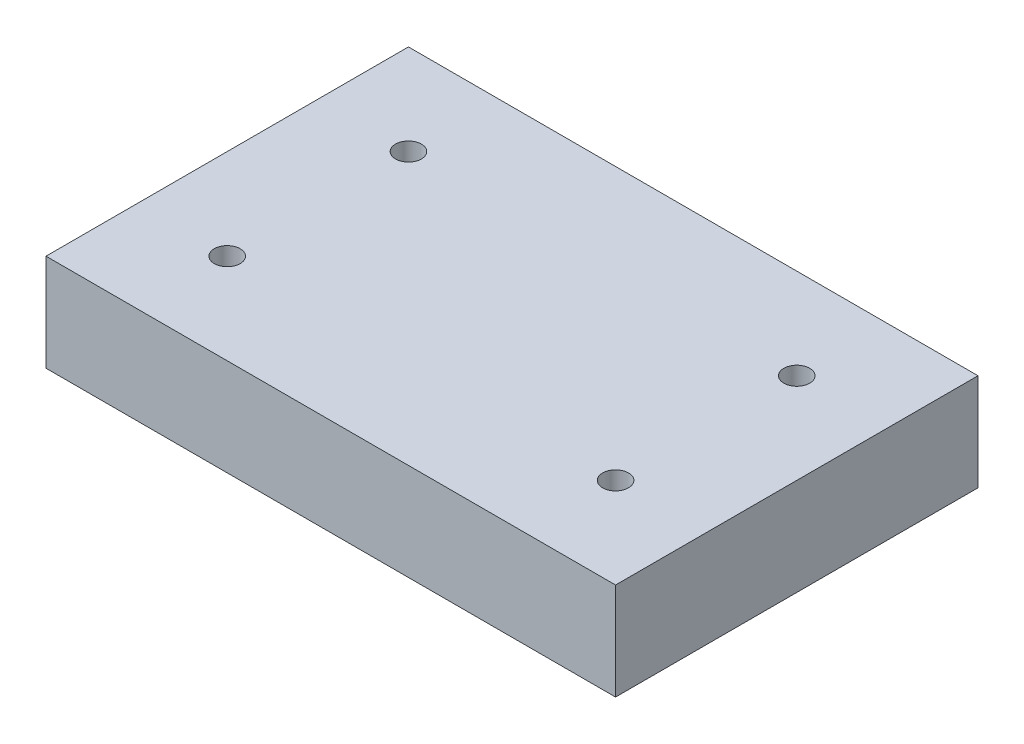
ISO-10303-21;
HEADER;
FILE_DESCRIPTION(('STEP AP214'),'2;1');
FILE_NAME('part.step','',(''),(''),'','','');
FILE_SCHEMA(('AUTOMOTIVE_DESIGN { 1 0 10303 214 1 1 1 1 }'));
ENDSEC;
DATA;
#1=APPLICATION_CONTEXT('core data for automotive mechanical design processes');
#2=APPLICATION_PROTOCOL_DEFINITION('international standard','automotive_design',2000,#1);
#3=PRODUCT_CONTEXT('',#1,'mechanical');
#4=PRODUCT('Part','Part','',(#3));
#5=PRODUCT_RELATED_PRODUCT_CATEGORY('part','',(#4));
#6=PRODUCT_DEFINITION_FORMATION('','',#4);
#7=PRODUCT_DEFINITION_CONTEXT('part definition',#1,'design');
#8=PRODUCT_DEFINITION('design','',#6,#7);
#9=PRODUCT_DEFINITION_SHAPE('','',#8);
#10=(LENGTH_UNIT() NAMED_UNIT(*) SI_UNIT(.MILLI.,.METRE.));
#11=(NAMED_UNIT(*) PLANE_ANGLE_UNIT() SI_UNIT($,.RADIAN.));
#12=(NAMED_UNIT(*) SI_UNIT($,.STERADIAN.) SOLID_ANGLE_UNIT());
#13=UNCERTAINTY_MEASURE_WITH_UNIT(LENGTH_MEASURE(1.E-05),#10,'distance_accuracy_value','');
#14=(GEOMETRIC_REPRESENTATION_CONTEXT(3) GLOBAL_UNCERTAINTY_ASSIGNED_CONTEXT((#13)) GLOBAL_UNIT_ASSIGNED_CONTEXT((#10,
#11,#12)) REPRESENTATION_CONTEXT('',''));
#15=CARTESIAN_POINT('',(0.,0.,0.));
#16=DIRECTION('',(0.,0.,1.));
#17=DIRECTION('',(1.,0.,0.));
#18=AXIS2_PLACEMENT_3D('',#15,#16,#17);
#19=CARTESIAN_POINT('',(0.,23.8125,-88.9));
#20=DIRECTION('',(1.,0.,0.));
#21=DIRECTION('',(0.,0.,-1.));
#22=AXIS2_PLACEMENT_3D('',#19,#20,#21);
#23=PLANE('',#22);
#24=DIRECTION('',(0.,0.,1.));
#25=VECTOR('',#24,1.);
#26=CARTESIAN_POINT('',(0.,0.,-88.9));
#27=LINE('',#26,#25);
#28=CARTESIAN_POINT('',(0.,0.,-88.9));
#29=VERTEX_POINT('',#28);
#30=CARTESIAN_POINT('',(0.,0.,0.));
#31=VERTEX_POINT('',#30);
#32=EDGE_CURVE('E96',#29,#31,#27,.T.);
#33=ORIENTED_EDGE('',*,*,#32,.T.);
#34=DIRECTION('',(0.,-1.,0.));
#35=VECTOR('',#34,1.);
#36=CARTESIAN_POINT('',(0.,23.8125,0.));
#37=LINE('',#36,#35);
#38=CARTESIAN_POINT('',(0.,23.8125,0.));
#39=VERTEX_POINT('',#38);
#40=EDGE_CURVE('E11',#39,#31,#37,.T.);
#41=ORIENTED_EDGE('',*,*,#40,.F.);
#42=DIRECTION('',(0.,0.,1.));
#43=VECTOR('',#42,1.);
#44=CARTESIAN_POINT('',(0.,23.8125,-88.9));
#45=LINE('',#44,#43);
#46=CARTESIAN_POINT('',(0.,23.8125,-88.9));
#47=VERTEX_POINT('',#46);
#48=EDGE_CURVE('E84',#47,#39,#45,.T.);
#49=ORIENTED_EDGE('',*,*,#48,.F.);
#50=DIRECTION('',(0.,-1.,0.));
#51=VECTOR('',#50,1.);
#52=CARTESIAN_POINT('',(0.,23.8125,-88.9));
#53=LINE('',#52,#51);
#54=EDGE_CURVE('E92',#47,#29,#53,.T.);
#55=ORIENTED_EDGE('',*,*,#54,.T.);
#56=EDGE_LOOP('',(#33,#41,#49,#55));
#57=FACE_BOUND('',#56,.T.);
#58=ADVANCED_FACE('F33',(#57),#23,.F.);
#59=CARTESIAN_POINT('',(0.,23.8125,0.));
#60=DIRECTION('',(0.,0.,-1.));
#61=DIRECTION('',(-1.,0.,0.));
#62=AXIS2_PLACEMENT_3D('',#59,#60,#61);
#63=PLANE('',#62);
#64=DIRECTION('',(1.,0.,0.));
#65=VECTOR('',#64,1.);
#66=CARTESIAN_POINT('',(0.,0.,0.));
#67=LINE('',#66,#65);
#68=CARTESIAN_POINT('',(139.7,0.,0.));
#69=VERTEX_POINT('',#68);
#70=EDGE_CURVE('E88',#31,#69,#67,.T.);
#71=ORIENTED_EDGE('',*,*,#70,.T.);
#72=DIRECTION('',(0.,-1.,0.));
#73=VECTOR('',#72,1.);
#74=CARTESIAN_POINT('',(139.7,23.8125,0.));
#75=LINE('',#74,#73);
#76=CARTESIAN_POINT('',(139.7,23.8125,0.));
#77=VERTEX_POINT('',#76);
#78=EDGE_CURVE('E41',#77,#69,#75,.T.);
#79=ORIENTED_EDGE('',*,*,#78,.F.);
#80=DIRECTION('',(1.,0.,0.));
#81=VECTOR('',#80,1.);
#82=CARTESIAN_POINT('',(0.,23.8125,0.));
#83=LINE('',#82,#81);
#84=EDGE_CURVE('E79',#39,#77,#83,.T.);
#85=ORIENTED_EDGE('',*,*,#84,.F.);
#86=ORIENTED_EDGE('',*,*,#40,.T.);
#87=EDGE_LOOP('',(#71,#79,#85,#86));
#88=FACE_BOUND('',#87,.T.);
#89=ADVANCED_FACE('F87',(#88),#63,.F.);
#90=CARTESIAN_POINT('',(139.7,23.8125,-88.9));
#91=DIRECTION('',(-1.,0.,0.));
#92=DIRECTION('',(0.,0.,1.));
#93=AXIS2_PLACEMENT_3D('',#90,#91,#92);
#94=PLANE('',#93);
#95=DIRECTION('',(0.,0.,-1.));
#96=VECTOR('',#95,1.);
#97=CARTESIAN_POINT('',(139.7,0.,-88.9));
#98=LINE('',#97,#96);
#99=CARTESIAN_POINT('',(139.7,0.,-88.9));
#100=VERTEX_POINT('',#99);
#101=EDGE_CURVE('E66',#69,#100,#98,.T.);
#102=ORIENTED_EDGE('',*,*,#101,.T.);
#103=DIRECTION('',(0.,-1.,0.));
#104=VECTOR('',#103,1.);
#105=CARTESIAN_POINT('',(139.7,23.8125,-88.9));
#106=LINE('',#105,#104);
#107=CARTESIAN_POINT('',(139.7,23.8125,-88.9));
#108=VERTEX_POINT('',#107);
#109=EDGE_CURVE('E89',#108,#100,#106,.T.);
#110=ORIENTED_EDGE('',*,*,#109,.F.);
#111=DIRECTION('',(0.,0.,-1.));
#112=VECTOR('',#111,1.);
#113=CARTESIAN_POINT('',(139.7,23.8125,-88.9));
#114=LINE('',#113,#112);
#115=EDGE_CURVE('E82',#77,#108,#114,.T.);
#116=ORIENTED_EDGE('',*,*,#115,.F.);
#117=ORIENTED_EDGE('',*,*,#78,.T.);
#118=EDGE_LOOP('',(#102,#110,#116,#117));
#119=FACE_BOUND('',#118,.T.);
#120=ADVANCED_FACE('F90',(#119),#94,.F.);
#121=CARTESIAN_POINT('',(0.,23.8125,-88.9));
#122=DIRECTION('',(0.,0.,1.));
#123=DIRECTION('',(1.,0.,0.));
#124=AXIS2_PLACEMENT_3D('',#121,#122,#123);
#125=PLANE('',#124);
#126=DIRECTION('',(-1.,0.,0.));
#127=VECTOR('',#126,1.);
#128=CARTESIAN_POINT('',(0.,0.,-88.9));
#129=LINE('',#128,#127);
#130=EDGE_CURVE('E72',#100,#29,#129,.T.);
#131=ORIENTED_EDGE('',*,*,#130,.T.);
#132=ORIENTED_EDGE('',*,*,#54,.F.);
#133=DIRECTION('',(-1.,0.,0.));
#134=VECTOR('',#133,1.);
#135=CARTESIAN_POINT('',(0.,23.8125,-88.9));
#136=LINE('',#135,#134);
#137=EDGE_CURVE('E49',#108,#47,#136,.T.);
#138=ORIENTED_EDGE('',*,*,#137,.F.);
#139=ORIENTED_EDGE('',*,*,#109,.T.);
#140=EDGE_LOOP('',(#131,#132,#138,#139));
#141=FACE_BOUND('',#140,.T.);
#142=ADVANCED_FACE('F104',(#141),#125,.F.);
#143=CARTESIAN_POINT('',(0.,23.8125,0.));
#144=DIRECTION('',(0.,1.,0.));
#145=DIRECTION('',(0.,0.,1.));
#146=AXIS2_PLACEMENT_3D('',#143,#144,#145);
#147=PLANE('',#146);
#148=CARTESIAN_POINT('',(22.225,23.8125,-66.675));
#149=DIRECTION('',(0.,1.,0.));
#150=DIRECTION('',(0.,0.,1.));
#151=AXIS2_PLACEMENT_3D('',#148,#149,#150);
#152=CIRCLE('',#151,3.17499999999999);
#153=CARTESIAN_POINT('',(22.225,23.8125,-63.5));
#154=VERTEX_POINT('',#153);
#155=EDGE_CURVE('E130',#154,#154,#152,.T.);
#156=ORIENTED_EDGE('',*,*,#155,.F.);
#157=EDGE_LOOP('',(#156));
#158=FACE_BOUND('',#157,.T.);
#159=CARTESIAN_POINT('',(117.475,23.8125,-66.675));
#160=DIRECTION('',(0.,1.,0.));
#161=DIRECTION('',(0.,0.,1.));
#162=AXIS2_PLACEMENT_3D('',#159,#160,#161);
#163=CIRCLE('',#162,3.17499999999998);
#164=CARTESIAN_POINT('',(117.475,23.8125,-63.5));
#165=VERTEX_POINT('',#164);
#166=EDGE_CURVE('E124',#165,#165,#163,.T.);
#167=ORIENTED_EDGE('',*,*,#166,.F.);
#168=EDGE_LOOP('',(#167));
#169=FACE_BOUND('',#168,.T.);
#170=CARTESIAN_POINT('',(117.475,23.8125,-22.225));
#171=DIRECTION('',(0.,1.,0.));
#172=DIRECTION('',(0.,0.,1.));
#173=AXIS2_PLACEMENT_3D('',#170,#171,#172);
#174=CIRCLE('',#173,3.17499999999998);
#175=CARTESIAN_POINT('',(117.475,23.8125,-19.05));
#176=VERTEX_POINT('',#175);
#177=EDGE_CURVE('E118',#176,#176,#174,.T.);
#178=ORIENTED_EDGE('',*,*,#177,.F.);
#179=EDGE_LOOP('',(#178));
#180=FACE_BOUND('',#179,.T.);
#181=CARTESIAN_POINT('',(22.225,23.8125,-22.225));
#182=DIRECTION('',(0.,1.,0.));
#183=DIRECTION('',(0.,0.,1.));
#184=AXIS2_PLACEMENT_3D('',#181,#182,#183);
#185=CIRCLE('',#184,3.17499999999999);
#186=CARTESIAN_POINT('',(22.225,23.8125,-19.05));
#187=VERTEX_POINT('',#186);
#188=EDGE_CURVE('E112',#187,#187,#185,.T.);
#189=ORIENTED_EDGE('',*,*,#188,.F.);
#190=EDGE_LOOP('',(#189));
#191=FACE_BOUND('',#190,.T.);
#192=ORIENTED_EDGE('',*,*,#48,.T.);
#193=ORIENTED_EDGE('',*,*,#84,.T.);
#194=ORIENTED_EDGE('',*,*,#115,.T.);
#195=ORIENTED_EDGE('',*,*,#137,.T.);
#196=EDGE_LOOP('',(#192,#193,#194,#195));
#197=FACE_BOUND('',#196,.T.);
#198=ADVANCED_FACE('F80',(#158,#169,#180,#191,#197),#147,.T.);
#199=CARTESIAN_POINT('',(0.,0.,0.));
#200=DIRECTION('',(0.,1.,0.));
#201=DIRECTION('',(0.,0.,1.));
#202=AXIS2_PLACEMENT_3D('',#199,#200,#201);
#203=PLANE('',#202);
#204=CARTESIAN_POINT('',(22.225,0.,-66.675));
#205=DIRECTION('',(0.,1.,0.));
#206=DIRECTION('',(0.,0.,1.));
#207=AXIS2_PLACEMENT_3D('',#204,#205,#206);
#208=CIRCLE('',#207,3.175);
#209=CARTESIAN_POINT('',(22.225,0.,-63.5));
#210=VERTEX_POINT('',#209);
#211=EDGE_CURVE('E127',#210,#210,#208,.T.);
#212=ORIENTED_EDGE('',*,*,#211,.T.);
#213=EDGE_LOOP('',(#212));
#214=FACE_BOUND('',#213,.T.);
#215=CARTESIAN_POINT('',(117.475,0.,-66.675));
#216=DIRECTION('',(0.,1.,0.));
#217=DIRECTION('',(0.,0.,1.));
#218=AXIS2_PLACEMENT_3D('',#215,#216,#217);
#219=CIRCLE('',#218,3.175);
#220=CARTESIAN_POINT('',(117.475,0.,-63.5));
#221=VERTEX_POINT('',#220);
#222=EDGE_CURVE('E121',#221,#221,#219,.T.);
#223=ORIENTED_EDGE('',*,*,#222,.T.);
#224=EDGE_LOOP('',(#223));
#225=FACE_BOUND('',#224,.T.);
#226=CARTESIAN_POINT('',(117.475,0.,-22.225));
#227=DIRECTION('',(0.,1.,0.));
#228=DIRECTION('',(0.,0.,1.));
#229=AXIS2_PLACEMENT_3D('',#226,#227,#228);
#230=CIRCLE('',#229,3.175);
#231=CARTESIAN_POINT('',(117.475,0.,-19.05));
#232=VERTEX_POINT('',#231);
#233=EDGE_CURVE('E115',#232,#232,#230,.T.);
#234=ORIENTED_EDGE('',*,*,#233,.T.);
#235=EDGE_LOOP('',(#234));
#236=FACE_BOUND('',#235,.T.);
#237=CARTESIAN_POINT('',(22.225,0.,-22.225));
#238=DIRECTION('',(0.,1.,0.));
#239=DIRECTION('',(0.,0.,1.));
#240=AXIS2_PLACEMENT_3D('',#237,#238,#239);
#241=CIRCLE('',#240,3.175);
#242=CARTESIAN_POINT('',(22.225,0.,-19.05));
#243=VERTEX_POINT('',#242);
#244=EDGE_CURVE('E99',#243,#243,#241,.T.);
#245=ORIENTED_EDGE('',*,*,#244,.T.);
#246=EDGE_LOOP('',(#245));
#247=FACE_BOUND('',#246,.T.);
#248=ORIENTED_EDGE('',*,*,#32,.F.);
#249=ORIENTED_EDGE('',*,*,#130,.F.);
#250=ORIENTED_EDGE('',*,*,#101,.F.);
#251=ORIENTED_EDGE('',*,*,#70,.F.);
#252=EDGE_LOOP('',(#248,#249,#250,#251));
#253=FACE_BOUND('',#252,.T.);
#254=ADVANCED_FACE('F107',(#214,#225,#236,#247,#253),#203,.F.);
#255=CARTESIAN_POINT('',(22.225,23.8125,-22.225));
#256=DIRECTION('',(0.,1.,0.));
#257=DIRECTION('',(0.,0.,1.));
#258=AXIS2_PLACEMENT_3D('',#255,#256,#257);
#259=CYLINDRICAL_SURFACE('',#258,3.17499999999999);
#260=ORIENTED_EDGE('',*,*,#244,.F.);
#261=EDGE_LOOP('',(#260));
#262=FACE_BOUND('',#261,.T.);
#263=ORIENTED_EDGE('',*,*,#188,.T.);
#264=EDGE_LOOP('',(#263));
#265=FACE_BOUND('',#264,.T.);
#266=ADVANCED_FACE('F145',(#262,#265),#259,.F.);
#267=CARTESIAN_POINT('',(117.475,23.8125,-22.225));
#268=DIRECTION('',(0.,1.,0.));
#269=DIRECTION('',(0.,0.,1.));
#270=AXIS2_PLACEMENT_3D('',#267,#268,#269);
#271=CYLINDRICAL_SURFACE('',#270,3.17499999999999);
#272=ORIENTED_EDGE('',*,*,#233,.F.);
#273=EDGE_LOOP('',(#272));
#274=FACE_BOUND('',#273,.T.);
#275=ORIENTED_EDGE('',*,*,#177,.T.);
#276=EDGE_LOOP('',(#275));
#277=FACE_BOUND('',#276,.T.);
#278=ADVANCED_FACE('F147',(#274,#277),#271,.F.);
#279=CARTESIAN_POINT('',(117.475,23.8125,-66.675));
#280=DIRECTION('',(0.,1.,0.));
#281=DIRECTION('',(0.,0.,1.));
#282=AXIS2_PLACEMENT_3D('',#279,#280,#281);
#283=CYLINDRICAL_SURFACE('',#282,3.17499999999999);
#284=ORIENTED_EDGE('',*,*,#222,.F.);
#285=EDGE_LOOP('',(#284));
#286=FACE_BOUND('',#285,.T.);
#287=ORIENTED_EDGE('',*,*,#166,.T.);
#288=EDGE_LOOP('',(#287));
#289=FACE_BOUND('',#288,.T.);
#290=ADVANCED_FACE('F154',(#286,#289),#283,.F.);
#291=CARTESIAN_POINT('',(22.225,23.8125,-66.675));
#292=DIRECTION('',(0.,1.,0.));
#293=DIRECTION('',(0.,0.,1.));
#294=AXIS2_PLACEMENT_3D('',#291,#292,#293);
#295=CYLINDRICAL_SURFACE('',#294,3.17499999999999);
#296=ORIENTED_EDGE('',*,*,#211,.F.);
#297=EDGE_LOOP('',(#296));
#298=FACE_BOUND('',#297,.T.);
#299=ORIENTED_EDGE('',*,*,#155,.T.);
#300=EDGE_LOOP('',(#299));
#301=FACE_BOUND('',#300,.T.);
#302=ADVANCED_FACE('F134',(#298,#301),#295,.F.);
#303=CLOSED_SHELL('',(#58,#89,#120,#142,#198,#254,#266,#278,#290,#302));
#304=MANIFOLD_SOLID_BREP('B2',#303);
#305=ADVANCED_BREP_SHAPE_REPRESENTATION('',(#18,#304),#14);
#306=SHAPE_DEFINITION_REPRESENTATION(#9,#305);
ENDSEC;
END-ISO-10303-21;
